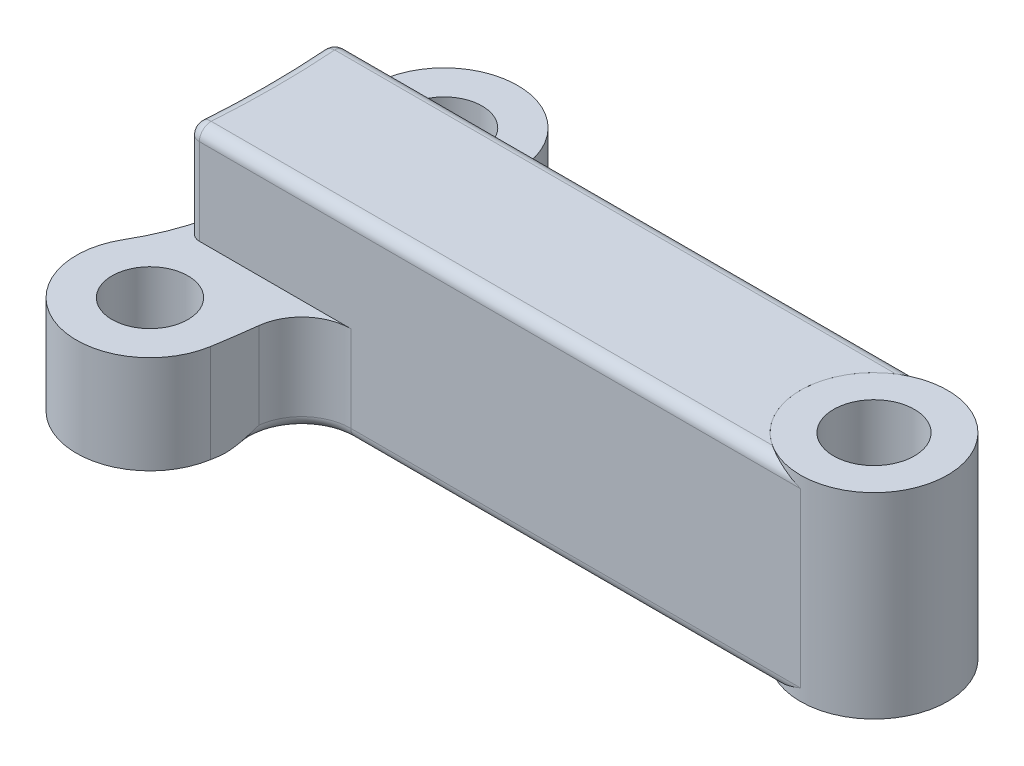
ISO-10303-21;
HEADER;
FILE_DESCRIPTION(('STEP AP214'),'2;1');
FILE_NAME('part.step','',(''),(''),'','','');
FILE_SCHEMA(('AUTOMOTIVE_DESIGN { 1 0 10303 214 1 1 1 1 }'));
ENDSEC;
DATA;
#1=APPLICATION_CONTEXT('core data for automotive mechanical design processes');
#2=APPLICATION_PROTOCOL_DEFINITION('international standard','automotive_design',2000,#1);
#3=PRODUCT_CONTEXT('',#1,'mechanical');
#4=PRODUCT('Part','Part','',(#3));
#5=PRODUCT_RELATED_PRODUCT_CATEGORY('part','',(#4));
#6=PRODUCT_DEFINITION_FORMATION('','',#4);
#7=PRODUCT_DEFINITION_CONTEXT('part definition',#1,'design');
#8=PRODUCT_DEFINITION('design','',#6,#7);
#9=PRODUCT_DEFINITION_SHAPE('','',#8);
#10=(LENGTH_UNIT() NAMED_UNIT(*) SI_UNIT(.MILLI.,.METRE.));
#11=(NAMED_UNIT(*) PLANE_ANGLE_UNIT() SI_UNIT($,.RADIAN.));
#12=(NAMED_UNIT(*) SI_UNIT($,.STERADIAN.) SOLID_ANGLE_UNIT());
#13=UNCERTAINTY_MEASURE_WITH_UNIT(LENGTH_MEASURE(1.E-05),#10,'distance_accuracy_value','');
#14=(GEOMETRIC_REPRESENTATION_CONTEXT(3) GLOBAL_UNCERTAINTY_ASSIGNED_CONTEXT((#13)) GLOBAL_UNIT_ASSIGNED_CONTEXT((#10,
#11,#12)) REPRESENTATION_CONTEXT('',''));
#15=CARTESIAN_POINT('',(0.,0.,0.));
#16=DIRECTION('',(0.,0.,1.));
#17=DIRECTION('',(1.,0.,0.));
#18=AXIS2_PLACEMENT_3D('',#15,#16,#17);
#19=CARTESIAN_POINT('',(5.027853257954,-0.00999999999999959,0.));
#20=DIRECTION('',(0.,1.,0.));
#21=DIRECTION('',(0.,0.,1.));
#22=AXIS2_PLACEMENT_3D('',#19,#20,#21);
#23=CYLINDRICAL_SURFACE('',#22,4.7625);
#24=CARTESIAN_POINT('',(5.027853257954,0.,0.));
#25=DIRECTION('',(0.,1.,0.));
#26=DIRECTION('',(0.,0.,1.));
#27=AXIS2_PLACEMENT_3D('',#24,#25,#26);
#28=CIRCLE('',#27,4.7625);
#29=CARTESIAN_POINT('',(5.027853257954,0.,4.7625));
#30=VERTEX_POINT('',#29);
#31=EDGE_CURVE('E56',#30,#30,#28,.T.);
#32=ORIENTED_EDGE('',*,*,#31,.T.);
#33=EDGE_LOOP('',(#32));
#34=FACE_BOUND('',#33,.T.);
#35=CARTESIAN_POINT('',(5.027853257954,12.7,0.));
#36=DIRECTION('',(0.,1.,0.));
#37=DIRECTION('',(0.,0.,1.));
#38=AXIS2_PLACEMENT_3D('',#35,#36,#37);
#39=CIRCLE('',#38,4.7625);
#40=CARTESIAN_POINT('',(5.027853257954,12.7,4.7625));
#41=VERTEX_POINT('',#40);
#42=EDGE_CURVE('E58',#41,#41,#39,.T.);
#43=ORIENTED_EDGE('',*,*,#42,.F.);
#44=EDGE_LOOP('',(#43));
#45=FACE_BOUND('',#44,.T.);
#46=ADVANCED_FACE('F45',(#34,#45),#23,.T.);
#47=CARTESIAN_POINT('',(5.027853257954,12.7,0.));
#48=DIRECTION('',(0.,-1.,0.));
#49=DIRECTION('',(0.,0.,-1.));
#50=AXIS2_PLACEMENT_3D('',#47,#48,#49);
#51=CYLINDRICAL_SURFACE('',#50,2.6162);
#52=CARTESIAN_POINT('',(5.027853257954,12.7,0.));
#53=DIRECTION('',(0.,1.,0.));
#54=DIRECTION('',(0.,0.,1.));
#55=AXIS2_PLACEMENT_3D('',#52,#53,#54);
#56=CIRCLE('',#55,2.6162);
#57=CARTESIAN_POINT('',(5.027853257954,12.7,2.6162));
#58=VERTEX_POINT('',#57);
#59=EDGE_CURVE('E49',#58,#58,#56,.T.);
#60=ORIENTED_EDGE('',*,*,#59,.T.);
#61=EDGE_LOOP('',(#60));
#62=FACE_BOUND('',#61,.T.);
#63=CARTESIAN_POINT('',(5.027853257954,0.,0.));
#64=DIRECTION('',(0.,1.,0.));
#65=DIRECTION('',(0.,0.,1.));
#66=AXIS2_PLACEMENT_3D('',#63,#64,#65);
#67=CIRCLE('',#66,2.6162);
#68=CARTESIAN_POINT('',(5.027853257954,0.,2.6162));
#69=VERTEX_POINT('',#68);
#70=EDGE_CURVE('E11',#69,#69,#67,.T.);
#71=ORIENTED_EDGE('',*,*,#70,.F.);
#72=EDGE_LOOP('',(#71));
#73=FACE_BOUND('',#72,.T.);
#74=ADVANCED_FACE('F71',(#62,#73),#51,.F.);
#75=CARTESIAN_POINT('',(5.027853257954,12.7,0.));
#76=DIRECTION('',(0.,1.,0.));
#77=DIRECTION('',(0.,0.,1.));
#78=AXIS2_PLACEMENT_3D('',#75,#76,#77);
#79=PLANE('',#78);
#80=ORIENTED_EDGE('',*,*,#59,.F.);
#81=EDGE_LOOP('',(#80));
#82=FACE_BOUND('',#81,.T.);
#83=ORIENTED_EDGE('',*,*,#42,.T.);
#84=EDGE_LOOP('',(#83));
#85=FACE_BOUND('',#84,.T.);
#86=ADVANCED_FACE('F67',(#82,#85),#79,.T.);
#87=CARTESIAN_POINT('',(5.027853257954,0.,0.));
#88=DIRECTION('',(0.,1.,0.));
#89=DIRECTION('',(0.,0.,1.));
#90=AXIS2_PLACEMENT_3D('',#87,#88,#89);
#91=PLANE('',#90);
#92=ORIENTED_EDGE('',*,*,#70,.T.);
#93=EDGE_LOOP('',(#92));
#94=FACE_BOUND('',#93,.T.);
#95=ORIENTED_EDGE('',*,*,#31,.F.);
#96=EDGE_LOOP('',(#95));
#97=FACE_BOUND('',#96,.T.);
#98=ADVANCED_FACE('F47',(#94,#97),#91,.F.);
#99=CLOSED_SHELL('',(#46,#74,#86,#98));
#100=MANIFOLD_SOLID_BREP('B2',#99);
#101=CARTESIAN_POINT('',(5.027853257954,-0.00999999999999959,0.));
#102=DIRECTION('',(0.,1.,0.));
#103=DIRECTION('',(0.,0.,1.));
#104=AXIS2_PLACEMENT_3D('',#101,#102,#103);
#105=CYLINDRICAL_SURFACE('',#104,4.7625);
#106=CARTESIAN_POINT('',(5.027853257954,0.,0.));
#107=DIRECTION('',(0.,1.,0.));
#108=DIRECTION('',(0.,0.,1.));
#109=AXIS2_PLACEMENT_3D('',#106,#107,#108);
#110=CIRCLE('',#109,4.7625);
#111=CARTESIAN_POINT('',(2.44378553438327,0.,-4.0005));
#112=VERTEX_POINT('',#111);
#113=CARTESIAN_POINT('',(2.44378553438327,0.,4.0005));
#114=VERTEX_POINT('',#113);
#115=EDGE_CURVE('E300',#112,#114,#110,.T.);
#116=ORIENTED_EDGE('',*,*,#115,.F.);
#117=CARTESIAN_POINT('',(2.44378553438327,0.,-4.0005));
#118=CARTESIAN_POINT('',(2.47813314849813,4.36418421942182E-06,-4.02268732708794));
#119=CARTESIAN_POINT('',(2.5127560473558,0.000968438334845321,-4.0444235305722));
#120=CARTESIAN_POINT('',(2.5824690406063,0.004618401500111,-4.08695083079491));
#121=CARTESIAN_POINT('',(2.617558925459,0.00730354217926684,-4.10774233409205));
#122=CARTESIAN_POINT('',(2.72327852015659,0.0176291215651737,-4.16856567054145));
#123=CARTESIAN_POINT('',(2.79452491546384,0.0275416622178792,-4.20715392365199));
#124=CARTESIAN_POINT('',(2.93775678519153,0.0521159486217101,-4.2801084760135));
#125=CARTESIAN_POINT('',(3.00973524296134,0.0667487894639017,-4.31449875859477));
#126=CARTESIAN_POINT('',(3.15462543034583,0.0998518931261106,-4.3793526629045));
#127=CARTESIAN_POINT('',(3.22753784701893,0.118325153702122,-4.4098131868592));
#128=CARTESIAN_POINT('',(3.41705593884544,0.170090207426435,-4.48355857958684));
#129=CARTESIAN_POINT('',(3.53418878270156,0.205715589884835,-4.52387700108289));
#130=CARTESIAN_POINT('',(3.76954514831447,0.282365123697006,-4.59490975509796));
#131=CARTESIAN_POINT('',(3.88776904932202,0.323391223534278,-4.62562060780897));
#132=CARTESIAN_POINT('',(4.24396957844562,0.452068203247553,-4.70383818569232));
#133=CARTESIAN_POINT('',(4.48321037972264,0.545237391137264,-4.73732879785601));
#134=CARTESIAN_POINT('',(4.82000784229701,0.678881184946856,-4.75896482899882));
#135=CARTESIAN_POINT('',(4.91751882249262,0.717867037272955,-4.762220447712));
#136=CARTESIAN_POINT('',(5.01930990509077,0.758582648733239,-4.76249424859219));
#137=CARTESIAN_POINT('',(5.02358157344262,0.760291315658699,-4.76249999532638));
#138=CARTESIAN_POINT('',(5.027853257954,0.762000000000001,-4.7625));
#139=B_SPLINE_CURVE_WITH_KNOTS('',3,(#117,#118,#119,#120,#121,#122,#123,#124,#125,#126,#127,
#128,#129,#130,#131,#132,#133,#134,#135,#136,#137,#138),.UNSPECIFIED.,.F.,.F.,(4,2,2,2,2,2,2,2,
2,2,4),(0.,0.122635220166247,0.245217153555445,0.489788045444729,0.73288885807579,
0.976180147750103,1.36226841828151,1.74849636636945,2.52182618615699,2.83692234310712,
2.85072452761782),.UNSPECIFIED.);
#140=CARTESIAN_POINT('',(5.027853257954,0.762000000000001,-4.7625));
#141=VERTEX_POINT('',#140);
#142=EDGE_CURVE('E407',#112,#141,#139,.T.);
#143=ORIENTED_EDGE('',*,*,#142,.T.);
#144=DIRECTION('',(0.,-1.,0.));
#145=VECTOR('',#144,1.);
#146=CARTESIAN_POINT('',(5.027853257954,12.7,-4.7625));
#147=LINE('',#146,#145);
#148=CARTESIAN_POINT('',(5.027853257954,11.938,-4.7625));
#149=VERTEX_POINT('',#148);
#150=EDGE_CURVE('E290',#149,#141,#147,.T.);
#151=ORIENTED_EDGE('',*,*,#150,.F.);
#152=CARTESIAN_POINT('',(2.44378553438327,12.7,-4.0005));
#153=CARTESIAN_POINT('',(2.47813314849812,12.6999956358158,-4.02268732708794));
#154=CARTESIAN_POINT('',(2.51275604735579,12.6990315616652,-4.04442353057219));
#155=CARTESIAN_POINT('',(2.58246904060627,12.6953815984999,-4.08695083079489));
#156=CARTESIAN_POINT('',(2.61755892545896,12.6926964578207,-4.10774233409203));
#157=CARTESIAN_POINT('',(2.72327852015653,12.6823708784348,-4.16856567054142));
#158=CARTESIAN_POINT('',(2.79452491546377,12.6724583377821,-4.20715392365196));
#159=CARTESIAN_POINT('',(2.93775678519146,12.6478840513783,-4.28010847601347));
#160=CARTESIAN_POINT('',(3.00973524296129,12.6332512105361,-4.31449875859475));
#161=CARTESIAN_POINT('',(3.15462543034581,12.6001481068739,-4.37935266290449));
#162=CARTESIAN_POINT('',(3.22753784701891,12.5816748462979,-4.4098131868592));
#163=CARTESIAN_POINT('',(3.41705593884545,12.5299097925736,-4.48355857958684));
#164=CARTESIAN_POINT('',(3.53418878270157,12.4942844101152,-4.5238770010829));
#165=CARTESIAN_POINT('',(3.76954514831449,12.417634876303,-4.59490975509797));
#166=CARTESIAN_POINT('',(3.88776904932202,12.3766087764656,-4.62562060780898));
#167=CARTESIAN_POINT('',(4.2439695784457,12.2479317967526,-4.70383818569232));
#168=CARTESIAN_POINT('',(4.48321037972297,12.1547626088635,-4.737328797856));
#169=CARTESIAN_POINT('',(4.82000784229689,12.0211188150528,-4.75896482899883));
#170=CARTESIAN_POINT('',(4.91751882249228,11.9821329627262,-4.76222044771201));
#171=CARTESIAN_POINT('',(5.01930990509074,11.9414173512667,-4.76249424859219));
#172=CARTESIAN_POINT('',(5.0235815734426,11.9397086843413,-4.76249999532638));
#173=CARTESIAN_POINT('',(5.027853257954,11.938,-4.7625));
#174=B_SPLINE_CURVE_WITH_KNOTS('',3,(#152,#153,#154,#155,#156,#157,#158,#159,#160,#161,#162,
#163,#164,#165,#166,#167,#168,#169,#170,#171,#172,#173),.UNSPECIFIED.,.F.,.F.,(4,2,2,2,2,2,2,2,
2,2,4),(0.,0.122635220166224,0.245217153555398,0.489788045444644,0.732888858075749,
0.976180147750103,1.36226841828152,1.74849636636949,2.521826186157,2.83692234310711,
2.85072452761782),.UNSPECIFIED.);
#175=CARTESIAN_POINT('',(2.44378553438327,12.7,-4.0005));
#176=VERTEX_POINT('',#175);
#177=EDGE_CURVE('E408',#149,#176,#174,.F.);
#178=ORIENTED_EDGE('',*,*,#177,.T.);
#179=CARTESIAN_POINT('',(5.027853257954,12.7,0.));
#180=DIRECTION('',(0.,1.,0.));
#181=DIRECTION('',(0.,0.,1.));
#182=AXIS2_PLACEMENT_3D('',#179,#180,#181);
#183=CIRCLE('',#182,4.7625);
#184=CARTESIAN_POINT('',(2.44378553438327,12.7,4.0005));
#185=VERTEX_POINT('',#184);
#186=EDGE_CURVE('E295',#176,#185,#183,.T.);
#187=ORIENTED_EDGE('',*,*,#186,.T.);
#188=CARTESIAN_POINT('',(2.44378553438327,12.7,4.0005));
#189=CARTESIAN_POINT('',(2.47813314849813,12.6999956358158,4.02268732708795));
#190=CARTESIAN_POINT('',(2.5127560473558,12.6990315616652,4.0444235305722));
#191=CARTESIAN_POINT('',(2.58246904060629,12.6953815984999,4.08695083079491));
#192=CARTESIAN_POINT('',(2.61755892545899,12.6926964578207,4.10774233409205));
#193=CARTESIAN_POINT('',(2.72327852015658,12.6823708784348,4.16856567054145));
#194=CARTESIAN_POINT('',(2.79452491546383,12.6724583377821,4.20715392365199));
#195=CARTESIAN_POINT('',(2.93775678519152,12.6478840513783,4.28010847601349));
#196=CARTESIAN_POINT('',(3.00973524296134,12.6332512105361,4.31449875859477));
#197=CARTESIAN_POINT('',(3.15462543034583,12.6001481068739,4.3793526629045));
#198=CARTESIAN_POINT('',(3.22753784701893,12.5816748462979,4.4098131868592));
#199=CARTESIAN_POINT('',(3.41705593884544,12.5299097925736,4.48355857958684));
#200=CARTESIAN_POINT('',(3.53418878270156,12.4942844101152,4.52387700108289));
#201=CARTESIAN_POINT('',(3.76954514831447,12.417634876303,4.59490975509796));
#202=CARTESIAN_POINT('',(3.88776904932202,12.3766087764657,4.62562060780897));
#203=CARTESIAN_POINT('',(4.24396957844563,12.2479317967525,4.70383818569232));
#204=CARTESIAN_POINT('',(4.48321037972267,12.1547626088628,4.73732879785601));
#205=CARTESIAN_POINT('',(4.820007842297,12.0211188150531,4.75896482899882));
#206=CARTESIAN_POINT('',(4.9175188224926,11.982132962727,4.762220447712));
#207=CARTESIAN_POINT('',(5.01930990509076,11.9414173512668,4.76249424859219));
#208=CARTESIAN_POINT('',(5.02358157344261,11.9397086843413,4.76249999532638));
#209=CARTESIAN_POINT('',(5.027853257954,11.938,4.7625));
#210=B_SPLINE_CURVE_WITH_KNOTS('',3,(#188,#189,#190,#191,#192,#193,#194,#195,#196,#197,#198,
#199,#200,#201,#202,#203,#204,#205,#206,#207,#208,#209),.UNSPECIFIED.,.F.,.F.,(4,2,2,2,2,2,2,2,
2,2,4),(0.,0.122635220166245,0.245217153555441,0.489788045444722,0.732888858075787,
0.976180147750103,1.36226841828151,1.74849636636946,2.52182618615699,2.83692234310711,
2.85072452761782),.UNSPECIFIED.);
#211=CARTESIAN_POINT('',(5.027853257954,11.938,4.7625));
#212=VERTEX_POINT('',#211);
#213=EDGE_CURVE('E385',#185,#212,#210,.T.);
#214=ORIENTED_EDGE('',*,*,#213,.T.);
#215=DIRECTION('',(0.,-1.,0.));
#216=VECTOR('',#215,1.);
#217=CARTESIAN_POINT('',(5.027853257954,12.7,4.7625));
#218=LINE('',#217,#216);
#219=CARTESIAN_POINT('',(5.027853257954,0.762000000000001,4.7625));
#220=VERTEX_POINT('',#219);
#221=EDGE_CURVE('E291',#212,#220,#218,.T.);
#222=ORIENTED_EDGE('',*,*,#221,.T.);
#223=CARTESIAN_POINT('',(2.44378553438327,0.,4.0005));
#224=CARTESIAN_POINT('',(2.47813314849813,4.36418421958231E-06,4.02268732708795));
#225=CARTESIAN_POINT('',(2.5127560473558,0.000968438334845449,4.0444235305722));
#226=CARTESIAN_POINT('',(2.5824690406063,0.00461840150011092,4.08695083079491));
#227=CARTESIAN_POINT('',(2.61755892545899,0.00730354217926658,4.10774233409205));
#228=CARTESIAN_POINT('',(2.72327852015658,0.0176291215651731,4.16856567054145));
#229=CARTESIAN_POINT('',(2.79452491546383,0.0275416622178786,4.20715392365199));
#230=CARTESIAN_POINT('',(2.93775678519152,0.0521159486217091,4.28010847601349));
#231=CARTESIAN_POINT('',(3.00973524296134,0.0667487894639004,4.31449875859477));
#232=CARTESIAN_POINT('',(3.15462543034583,0.0998518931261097,4.3793526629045));
#233=CARTESIAN_POINT('',(3.22753784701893,0.118325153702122,4.4098131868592));
#234=CARTESIAN_POINT('',(3.41705593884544,0.170090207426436,4.48355857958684));
#235=CARTESIAN_POINT('',(3.53418878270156,0.205715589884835,4.52387700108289));
#236=CARTESIAN_POINT('',(3.76954514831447,0.282365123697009,4.59490975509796));
#237=CARTESIAN_POINT('',(3.88776904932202,0.323391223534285,4.62562060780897));
#238=CARTESIAN_POINT('',(4.24396957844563,0.452068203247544,4.70383818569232));
#239=CARTESIAN_POINT('',(4.48321037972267,0.545237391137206,4.73732879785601));
#240=CARTESIAN_POINT('',(4.82000784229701,0.678881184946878,4.75896482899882));
#241=CARTESIAN_POINT('',(4.9175188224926,0.717867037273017,4.762220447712));
#242=CARTESIAN_POINT('',(5.01930990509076,0.758582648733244,4.76249424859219));
#243=CARTESIAN_POINT('',(5.02358157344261,0.760291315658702,4.76249999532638));
#244=CARTESIAN_POINT('',(5.027853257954,0.762000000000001,4.7625));
#245=B_SPLINE_CURVE_WITH_KNOTS('',3,(#223,#224,#225,#226,#227,#228,#229,#230,#231,#232,#233,
#234,#235,#236,#237,#238,#239,#240,#241,#242,#243,#244),.UNSPECIFIED.,.F.,.F.,(4,2,2,2,2,2,2,2,
2,2,4),(0.,0.122635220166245,0.245217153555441,0.489788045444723,0.732888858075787,
0.976180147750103,1.36226841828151,1.74849636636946,2.521826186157,2.83692234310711,
2.85072452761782),.UNSPECIFIED.);
#246=EDGE_CURVE('E402',#220,#114,#245,.F.);
#247=ORIENTED_EDGE('',*,*,#246,.T.);
#248=EDGE_LOOP('',(#116,#143,#151,#178,#187,#214,#222,#247));
#249=FACE_BOUND('',#248,.T.);
#250=ADVANCED_FACE('F113',(#249),#105,.F.);
#251=CARTESIAN_POINT('',(-34.7236357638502,12.7,-4.76249999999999));
#252=DIRECTION('',(0.,0.,1.));
#253=DIRECTION('',(1.,0.,0.));
#254=AXIS2_PLACEMENT_3D('',#251,#252,#253);
#255=PLANE('',#254);
#256=ORIENTED_EDGE('',*,*,#150,.T.);
#257=DIRECTION('',(-1.,0.,0.));
#258=VECTOR('',#257,1.);
#259=CARTESIAN_POINT('',(-34.7236357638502,0.762000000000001,-4.76249999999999));
#260=LINE('',#259,#258);
#261=CARTESIAN_POINT('',(-24.0975029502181,0.762000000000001,-4.76249999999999));
#262=VERTEX_POINT('',#261);
#263=EDGE_CURVE('E336',#141,#262,#260,.T.);
#264=ORIENTED_EDGE('',*,*,#263,.T.);
#265=DIRECTION('',(0.,1.,0.));
#266=VECTOR('',#265,1.);
#267=CARTESIAN_POINT('',(-24.0975029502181,6.35,-4.76249999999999));
#268=LINE('',#267,#266);
#269=CARTESIAN_POINT('',(-24.0975029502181,6.35,-4.76249999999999));
#270=VERTEX_POINT('',#269);
#271=EDGE_CURVE('E306',#262,#270,#268,.T.);
#272=ORIENTED_EDGE('',*,*,#271,.T.);
#273=DIRECTION('',(1.,0.,0.));
#274=VECTOR('',#273,1.);
#275=CARTESIAN_POINT('',(-34.7236357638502,6.35,-4.76249999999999));
#276=LINE('',#275,#274);
#277=CARTESIAN_POINT('',(-33.8996514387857,6.35,-4.76249999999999));
#278=VERTEX_POINT('',#277);
#279=EDGE_CURVE('E288',#278,#270,#276,.T.);
#280=ORIENTED_EDGE('',*,*,#279,.F.);
#281=DIRECTION('',(0.,-1.,0.));
#282=VECTOR('',#281,1.);
#283=CARTESIAN_POINT('',(-33.8996514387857,12.7,-4.76249999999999));
#284=LINE('',#283,#282);
#285=CARTESIAN_POINT('',(-33.8996514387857,11.938,-4.76249999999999));
#286=VERTEX_POINT('',#285);
#287=EDGE_CURVE('E334',#278,#286,#284,.F.);
#288=ORIENTED_EDGE('',*,*,#287,.T.);
#289=DIRECTION('',(-1.,0.,0.));
#290=VECTOR('',#289,1.);
#291=CARTESIAN_POINT('',(5.027853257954,11.938,-4.7625));
#292=LINE('',#291,#290);
#293=EDGE_CURVE('E332',#286,#149,#292,.F.);
#294=ORIENTED_EDGE('',*,*,#293,.T.);
#295=EDGE_LOOP('',(#256,#264,#272,#280,#288,#294));
#296=FACE_BOUND('',#295,.T.);
#297=ADVANCED_FACE('F421',(#296),#255,.F.);
#298=CARTESIAN_POINT('',(-90.298346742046,12.7,1.97098871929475E-13));
#299=DIRECTION('',(0.,-1.,0.));
#300=DIRECTION('',(0.,0.,-1.));
#301=AXIS2_PLACEMENT_3D('',#298,#299,#300);
#302=CYLINDRICAL_SURFACE('',#301,55.7784);
#303=CARTESIAN_POINT('',(-90.298346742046,11.938,1.97098871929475E-13));
#304=DIRECTION('',(0.,1.,0.));
#305=DIRECTION('',(0.,0.,1.));
#306=AXIS2_PLACEMENT_3D('',#303,#304,#305);
#307=CIRCLE('',#306,55.7784);
#308=CARTESIAN_POINT('',(-34.6597416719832,11.938,3.94658490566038));
#309=VERTEX_POINT('',#308);
#310=CARTESIAN_POINT('',(-34.6597416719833,11.938,-3.94658490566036));
#311=VERTEX_POINT('',#310);
#312=EDGE_CURVE('E328',#309,#311,#307,.T.);
#313=ORIENTED_EDGE('',*,*,#312,.T.);
#314=DIRECTION('',(0.,-1.,0.));
#315=VECTOR('',#314,1.);
#316=CARTESIAN_POINT('',(-34.6597416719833,12.7,-3.94658490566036));
#317=LINE('',#316,#315);
#318=CARTESIAN_POINT('',(-34.6597416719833,6.35,-3.94658490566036));
#319=VERTEX_POINT('',#318);
#320=EDGE_CURVE('E330',#311,#319,#317,.T.);
#321=ORIENTED_EDGE('',*,*,#320,.T.);
#322=CARTESIAN_POINT('',(-90.298346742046,6.35,1.97098871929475E-13));
#323=DIRECTION('',(0.,-1.,0.));
#324=DIRECTION('',(0.,0.,-1.));
#325=AXIS2_PLACEMENT_3D('',#322,#323,#324);
#326=CIRCLE('',#325,55.7784);
#327=CARTESIAN_POINT('',(-34.519946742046,6.35,0.));
#328=VERTEX_POINT('',#327);
#329=EDGE_CURVE('E282',#328,#319,#326,.F.);
#330=ORIENTED_EDGE('',*,*,#329,.F.);
#331=CARTESIAN_POINT('',(-34.6597416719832,6.35,3.94658490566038));
#332=VERTEX_POINT('',#331);
#333=EDGE_CURVE('E258',#332,#328,#326,.F.);
#334=ORIENTED_EDGE('',*,*,#333,.F.);
#335=DIRECTION('',(0.,-1.,0.));
#336=VECTOR('',#335,1.);
#337=CARTESIAN_POINT('',(-34.6597416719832,12.7,3.94658490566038));
#338=LINE('',#337,#336);
#339=EDGE_CURVE('E326',#332,#309,#338,.F.);
#340=ORIENTED_EDGE('',*,*,#339,.T.);
#341=EDGE_LOOP('',(#313,#321,#330,#334,#340));
#342=FACE_BOUND('',#341,.T.);
#343=ADVANCED_FACE('F551',(#342),#302,.F.);
#344=CARTESIAN_POINT('',(-34.7236357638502,12.7,4.7625));
#345=DIRECTION('',(0.,0.,-1.));
#346=DIRECTION('',(-1.,0.,0.));
#347=AXIS2_PLACEMENT_3D('',#344,#345,#346);
#348=PLANE('',#347);
#349=DIRECTION('',(0.,1.,0.));
#350=VECTOR('',#349,1.);
#351=CARTESIAN_POINT('',(-24.0975029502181,0.,4.7625));
#352=LINE('',#351,#350);
#353=CARTESIAN_POINT('',(-24.0975029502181,6.35,4.7625));
#354=VERTEX_POINT('',#353);
#355=CARTESIAN_POINT('',(-24.0975029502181,0.762000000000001,4.7625));
#356=VERTEX_POINT('',#355);
#357=EDGE_CURVE('E311',#354,#356,#352,.F.);
#358=ORIENTED_EDGE('',*,*,#357,.T.);
#359=DIRECTION('',(1.,0.,0.));
#360=VECTOR('',#359,1.);
#361=CARTESIAN_POINT('',(-34.7236357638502,0.762000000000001,4.7625));
#362=LINE('',#361,#360);
#363=EDGE_CURVE('E343',#356,#220,#362,.T.);
#364=ORIENTED_EDGE('',*,*,#363,.T.);
#365=ORIENTED_EDGE('',*,*,#221,.F.);
#366=DIRECTION('',(1.,0.,0.));
#367=VECTOR('',#366,1.);
#368=CARTESIAN_POINT('',(-34.7236357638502,11.938,4.7625));
#369=LINE('',#368,#367);
#370=CARTESIAN_POINT('',(-33.8996514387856,11.938,4.7625));
#371=VERTEX_POINT('',#370);
#372=EDGE_CURVE('E339',#212,#371,#369,.F.);
#373=ORIENTED_EDGE('',*,*,#372,.T.);
#374=DIRECTION('',(0.,-1.,0.));
#375=VECTOR('',#374,1.);
#376=CARTESIAN_POINT('',(-33.8996514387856,12.7,4.7625));
#377=LINE('',#376,#375);
#378=CARTESIAN_POINT('',(-33.8996514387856,6.35,4.7625));
#379=VERTEX_POINT('',#378);
#380=EDGE_CURVE('E341',#371,#379,#377,.T.);
#381=ORIENTED_EDGE('',*,*,#380,.T.);
#382=DIRECTION('',(-1.,0.,0.));
#383=VECTOR('',#382,1.);
#384=CARTESIAN_POINT('',(-34.7236357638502,6.35,4.7625));
#385=LINE('',#384,#383);
#386=EDGE_CURVE('E298',#354,#379,#385,.T.);
#387=ORIENTED_EDGE('',*,*,#386,.F.);
#388=EDGE_LOOP('',(#358,#364,#365,#373,#381,#387));
#389=FACE_BOUND('',#388,.T.);
#390=ADVANCED_FACE('F539',(#389),#348,.F.);
#391=CARTESIAN_POINT('',(5.027853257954,12.7,0.));
#392=DIRECTION('',(0.,1.,0.));
#393=DIRECTION('',(0.,0.,1.));
#394=AXIS2_PLACEMENT_3D('',#391,#392,#393);
#395=PLANE('',#394);
#396=ORIENTED_EDGE('',*,*,#186,.F.);
#397=DIRECTION('',(-1.,0.,0.));
#398=VECTOR('',#397,1.);
#399=CARTESIAN_POINT('',(-34.7236357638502,12.7,-4.00049999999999));
#400=LINE('',#399,#398);
#401=CARTESIAN_POINT('',(-33.8996514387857,12.7,-4.00049999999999));
#402=VERTEX_POINT('',#401);
#403=EDGE_CURVE('E324',#176,#402,#400,.T.);
#404=ORIENTED_EDGE('',*,*,#403,.T.);
#405=CARTESIAN_POINT('',(-90.298346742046,12.7,1.97098871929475E-13));
#406=DIRECTION('',(0.,1.,0.));
#407=DIRECTION('',(0.,0.,1.));
#408=AXIS2_PLACEMENT_3D('',#405,#406,#407);
#409=CIRCLE('',#408,56.5404);
#410=CARTESIAN_POINT('',(-33.8996514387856,12.7,4.0005));
#411=VERTEX_POINT('',#410);
#412=EDGE_CURVE('E321',#402,#411,#409,.F.);
#413=ORIENTED_EDGE('',*,*,#412,.T.);
#414=DIRECTION('',(1.,0.,0.));
#415=VECTOR('',#414,1.);
#416=CARTESIAN_POINT('',(5.027853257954,12.7,4.0005));
#417=LINE('',#416,#415);
#418=EDGE_CURVE('E319',#411,#185,#417,.T.);
#419=ORIENTED_EDGE('',*,*,#418,.T.);
#420=EDGE_LOOP('',(#396,#404,#413,#419));
#421=FACE_BOUND('',#420,.T.);
#422=ADVANCED_FACE('F589',(#421),#395,.T.);
#423=CARTESIAN_POINT('',(5.027853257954,0.,0.));
#424=DIRECTION('',(0.,1.,0.));
#425=DIRECTION('',(0.,0.,1.));
#426=AXIS2_PLACEMENT_3D('',#423,#424,#425);
#427=PLANE('',#426);
#428=CARTESIAN_POINT('',(-32.3382891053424,0.,9.525));
#429=DIRECTION('',(0.,1.,0.));
#430=DIRECTION('',(0.,0.,1.));
#431=AXIS2_PLACEMENT_3D('',#428,#429,#430);
#432=CIRCLE('',#431,2.45745);
#433=CARTESIAN_POINT('',(-32.3382891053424,0.,11.98245));
#434=VERTEX_POINT('',#433);
#435=EDGE_CURVE('E561',#434,#434,#432,.T.);
#436=ORIENTED_EDGE('',*,*,#435,.T.);
#437=EDGE_LOOP('',(#436));
#438=FACE_BOUND('',#437,.T.);
#439=CARTESIAN_POINT('',(-32.3382891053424,0.,-9.525));
#440=DIRECTION('',(0.,1.,0.));
#441=DIRECTION('',(0.,0.,1.));
#442=AXIS2_PLACEMENT_3D('',#439,#440,#441);
#443=CIRCLE('',#442,2.45745);
#444=CARTESIAN_POINT('',(-32.3382891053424,0.,-7.06755));
#445=VERTEX_POINT('',#444);
#446=EDGE_CURVE('E553',#445,#445,#443,.T.);
#447=ORIENTED_EDGE('',*,*,#446,.T.);
#448=EDGE_LOOP('',(#447));
#449=FACE_BOUND('',#448,.T.);
#450=CARTESIAN_POINT('',(-90.298346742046,0.,1.97098871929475E-13));
#451=DIRECTION('',(0.,1.,0.));
#452=DIRECTION('',(0.,0.,1.));
#453=AXIS2_PLACEMENT_3D('',#450,#451,#452);
#454=CIRCLE('',#453,63.5);
#455=CARTESIAN_POINT('',(-27.5606895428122,0.,-9.81001371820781));
#456=VERTEX_POINT('',#455);
#457=CARTESIAN_POINT('',(-27.6388249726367,0.,-10.2972972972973));
#458=VERTEX_POINT('',#457);
#459=EDGE_CURVE('E505',#456,#458,#454,.T.);
#460=ORIENTED_EDGE('',*,*,#459,.F.);
#461=CARTESIAN_POINT('',(-24.0975029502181,0.,-7.93749999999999));
#462=DIRECTION('',(0.,1.,0.));
#463=DIRECTION('',(0.,0.,1.));
#464=AXIS2_PLACEMENT_3D('',#461,#462,#463);
#465=CIRCLE('',#464,3.937);
#466=CARTESIAN_POINT('',(-24.0975029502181,0.,-4.00049999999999));
#467=VERTEX_POINT('',#466);
#468=EDGE_CURVE('E353',#456,#467,#465,.T.);
#469=ORIENTED_EDGE('',*,*,#468,.T.);
#470=DIRECTION('',(-1.,0.,0.));
#471=VECTOR('',#470,1.);
#472=CARTESIAN_POINT('',(5.027853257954,0.,-4.0005));
#473=LINE('',#472,#471);
#474=EDGE_CURVE('E350',#467,#112,#473,.F.);
#475=ORIENTED_EDGE('',*,*,#474,.T.);
#476=ORIENTED_EDGE('',*,*,#115,.T.);
#477=DIRECTION('',(1.,0.,0.));
#478=VECTOR('',#477,1.);
#479=CARTESIAN_POINT('',(5.027853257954,0.,4.0005));
#480=LINE('',#479,#478);
#481=CARTESIAN_POINT('',(-24.0975029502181,0.,4.0005));
#482=VERTEX_POINT('',#481);
#483=EDGE_CURVE('E345',#114,#482,#480,.F.);
#484=ORIENTED_EDGE('',*,*,#483,.T.);
#485=CARTESIAN_POINT('',(-24.0975029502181,0.,7.9375));
#486=DIRECTION('',(0.,1.,0.));
#487=DIRECTION('',(0.,0.,1.));
#488=AXIS2_PLACEMENT_3D('',#485,#486,#487);
#489=CIRCLE('',#488,3.937);
#490=CARTESIAN_POINT('',(-27.5606895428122,0.,9.81001371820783));
#491=VERTEX_POINT('',#490);
#492=EDGE_CURVE('E347',#482,#491,#489,.T.);
#493=ORIENTED_EDGE('',*,*,#492,.T.);
#494=CARTESIAN_POINT('',(-27.6388249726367,0.,10.2972972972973));
#495=VERTEX_POINT('',#494);
#496=EDGE_CURVE('E509',#495,#491,#454,.T.);
#497=ORIENTED_EDGE('',*,*,#496,.F.);
#498=CARTESIAN_POINT('',(-32.3382891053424,0.,9.52500000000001));
#499=DIRECTION('',(0.,1.,0.));
#500=DIRECTION('',(0.,0.,-1.));
#501=AXIS2_PLACEMENT_3D('',#498,#499,#500);
#502=CIRCLE('',#501,4.7625);
#503=CARTESIAN_POINT('',(-36.4493261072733,0.,7.12067451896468));
#504=VERTEX_POINT('',#503);
#505=EDGE_CURVE('E510',#504,#495,#502,.T.);
#506=ORIENTED_EDGE('',*,*,#505,.F.);
#507=CARTESIAN_POINT('',(-48.6246146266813,0.,0.));
#508=DIRECTION('',(0.,-1.,0.));
#509=DIRECTION('',(0.,0.,-1.));
#510=AXIS2_PLACEMENT_3D('',#507,#508,#509);
#511=CIRCLE('',#510,14.1046678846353);
#512=CARTESIAN_POINT('',(-36.4493261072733,0.,-7.12067451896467));
#513=VERTEX_POINT('',#512);
#514=EDGE_CURVE('E279',#513,#504,#511,.T.);
#515=ORIENTED_EDGE('',*,*,#514,.F.);
#516=CARTESIAN_POINT('',(-32.3382891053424,0.,-9.525));
#517=DIRECTION('',(0.,1.,0.));
#518=DIRECTION('',(0.,0.,1.));
#519=AXIS2_PLACEMENT_3D('',#516,#517,#518);
#520=CIRCLE('',#519,4.7625);
#521=EDGE_CURVE('E265',#458,#513,#520,.T.);
#522=ORIENTED_EDGE('',*,*,#521,.F.);
#523=EDGE_LOOP('',(#460,#469,#475,#476,#484,#493,#497,#506,#515,#522));
#524=FACE_BOUND('',#523,.T.);
#525=ADVANCED_FACE('F503',(#438,#449,#524),#427,.F.);
#526=CARTESIAN_POINT('',(-48.6246146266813,6.35,0.));
#527=DIRECTION('',(0.,-1.,0.));
#528=DIRECTION('',(0.,0.,-1.));
#529=AXIS2_PLACEMENT_3D('',#526,#527,#528);
#530=CYLINDRICAL_SURFACE('',#529,14.1046678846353);
#531=CARTESIAN_POINT('',(-48.6246146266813,6.35,0.));
#532=DIRECTION('',(0.,-1.,0.));
#533=DIRECTION('',(0.,0.,-1.));
#534=AXIS2_PLACEMENT_3D('',#531,#532,#533);
#535=CIRCLE('',#534,14.1046678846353);
#536=CARTESIAN_POINT('',(-36.4493261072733,6.35,7.12067451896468));
#537=VERTEX_POINT('',#536);
#538=EDGE_CURVE('E250',#328,#537,#535,.T.);
#539=ORIENTED_EDGE('',*,*,#538,.F.);
#540=CARTESIAN_POINT('',(-36.4493261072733,6.35,-7.12067451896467));
#541=VERTEX_POINT('',#540);
#542=EDGE_CURVE('E264',#541,#328,#535,.T.);
#543=ORIENTED_EDGE('',*,*,#542,.F.);
#544=DIRECTION('',(0.,-1.,0.));
#545=VECTOR('',#544,1.);
#546=CARTESIAN_POINT('',(-36.4493261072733,6.35,-7.12067451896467));
#547=LINE('',#546,#545);
#548=EDGE_CURVE('E516',#541,#513,#547,.T.);
#549=ORIENTED_EDGE('',*,*,#548,.T.);
#550=ORIENTED_EDGE('',*,*,#514,.T.);
#551=DIRECTION('',(0.,-1.,0.));
#552=VECTOR('',#551,1.);
#553=CARTESIAN_POINT('',(-36.4493261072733,6.35,7.12067451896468));
#554=LINE('',#553,#552);
#555=EDGE_CURVE('E270',#537,#504,#554,.T.);
#556=ORIENTED_EDGE('',*,*,#555,.F.);
#557=EDGE_LOOP('',(#539,#543,#549,#550,#556));
#558=FACE_BOUND('',#557,.T.);
#559=ADVANCED_FACE('F277',(#558),#530,.F.);
#560=CARTESIAN_POINT('',(-90.298346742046,6.35,1.97098871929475E-13));
#561=DIRECTION('',(0.,-1.,0.));
#562=DIRECTION('',(0.,0.,-1.));
#563=AXIS2_PLACEMENT_3D('',#560,#561,#562);
#564=CYLINDRICAL_SURFACE('',#563,63.5);
#565=DIRECTION('',(0.,-1.,0.));
#566=VECTOR('',#565,1.);
#567=CARTESIAN_POINT('',(-27.2499240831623,6.35,-7.55952380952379));
#568=LINE('',#567,#566);
#569=CARTESIAN_POINT('',(-27.2499240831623,6.35,-7.55952380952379));
#570=VERTEX_POINT('',#569);
#571=CARTESIAN_POINT('',(-27.2499240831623,0.762,-7.55952380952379));
#572=VERTEX_POINT('',#571);
#573=EDGE_CURVE('E294',#570,#572,#568,.T.);
#574=ORIENTED_EDGE('',*,*,#573,.T.);
#575=CARTESIAN_POINT('',(-27.5606895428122,0.,-9.81001371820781));
#576=CARTESIAN_POINT('',(-27.5545286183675,3.53396928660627E-06,-9.7706135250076));
#577=CARTESIAN_POINT('',(-27.5484074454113,0.00114840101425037,-9.73122321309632));
#578=CARTESIAN_POINT('',(-27.5362596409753,0.00551059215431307,-9.65256458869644));
#579=CARTESIAN_POINT('',(-27.5302329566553,0.00872671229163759,-9.61329621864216));
#580=CARTESIAN_POINT('',(-27.5123439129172,0.0211432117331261,-9.49600384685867));
#581=CARTESIAN_POINT('',(-27.5006338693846,0.0331144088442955,-9.41824504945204));
#582=CARTESIAN_POINT('',(-27.4778235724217,0.0628642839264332,-9.26486963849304));
#583=CARTESIAN_POINT('',(-27.4667173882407,0.0805657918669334,-9.18923832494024));
#584=CARTESIAN_POINT('',(-27.4449470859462,0.120730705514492,-9.03913194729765));
#585=CARTESIAN_POINT('',(-27.4342833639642,0.143198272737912,-8.96465795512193));
#586=CARTESIAN_POINT('',(-27.4076923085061,0.20524691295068,-8.77661075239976));
#587=CARTESIAN_POINT('',(-27.3920677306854,0.247476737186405,-8.66387578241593));
#588=CARTESIAN_POINT('',(-27.3617577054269,0.33820526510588,-8.44087681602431));
#589=CARTESIAN_POINT('',(-27.3470723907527,0.386704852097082,-8.33061317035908));
#590=CARTESIAN_POINT('',(-27.304107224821,0.53850984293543,-8.00156757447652));
#591=CARTESIAN_POINT('',(-27.2770451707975,0.647781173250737,-7.78543317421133));
#592=CARTESIAN_POINT('',(-27.2507044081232,0.758710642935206,-7.56602976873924));
#593=CARTESIAN_POINT('',(-27.2503141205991,0.760355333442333,-7.56277679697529));
#594=CARTESIAN_POINT('',(-27.2499240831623,0.762,-7.55952380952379));
#595=B_SPLINE_CURVE_WITH_KNOTS('',3,(#575,#576,#577,#578,#579,#580,#581,#582,#583,#584,#585,
#586,#587,#588,#589,#590,#591,#592,#593,#594),.UNSPECIFIED.,.F.,.F.,(4,2,2,2,2,2,2,2,2,4),(0.,
0.119595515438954,0.239121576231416,0.477425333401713,0.712644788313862,0.948070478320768,
1.31195226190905,1.6758853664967,2.40666009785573,2.41765793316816),.UNSPECIFIED.);
#596=EDGE_CURVE('E380',#572,#456,#595,.F.);
#597=ORIENTED_EDGE('',*,*,#596,.T.);
#598=ORIENTED_EDGE('',*,*,#459,.T.);
#599=DIRECTION('',(0.,-1.,0.));
#600=VECTOR('',#599,1.);
#601=CARTESIAN_POINT('',(-27.6388249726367,6.35,-10.2972972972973));
#602=LINE('',#601,#600);
#603=CARTESIAN_POINT('',(-27.6388249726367,6.35,-10.2972972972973));
#604=VERTEX_POINT('',#603);
#605=EDGE_CURVE('E284',#604,#458,#602,.T.);
#606=ORIENTED_EDGE('',*,*,#605,.F.);
#607=CARTESIAN_POINT('',(-90.298346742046,6.35,1.97098871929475E-13));
#608=DIRECTION('',(0.,1.,0.));
#609=DIRECTION('',(0.,0.,1.));
#610=AXIS2_PLACEMENT_3D('',#607,#608,#609);
#611=CIRCLE('',#610,63.5);
#612=EDGE_CURVE('E275',#570,#604,#611,.T.);
#613=ORIENTED_EDGE('',*,*,#612,.F.);
#614=EDGE_LOOP('',(#574,#597,#598,#606,#613));
#615=FACE_BOUND('',#614,.T.);
#616=ADVANCED_FACE('F368',(#615),#564,.T.);
#617=ORIENTED_EDGE('',*,*,#496,.T.);
#618=CARTESIAN_POINT('',(-27.5606895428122,0.,9.81001371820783));
#619=CARTESIAN_POINT('',(-27.5545286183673,3.53396928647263E-06,9.77061352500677));
#620=CARTESIAN_POINT('',(-27.5484074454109,0.00114840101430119,9.73122321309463));
#621=CARTESIAN_POINT('',(-27.5362596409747,0.0055105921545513,9.65256458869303));
#622=CARTESIAN_POINT('',(-27.5302329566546,0.00872671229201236,9.6132962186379));
#623=CARTESIAN_POINT('',(-27.5123439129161,0.0211432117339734,9.49600384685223));
#624=CARTESIAN_POINT('',(-27.5006338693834,0.0331144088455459,9.41824504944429));
#625=CARTESIAN_POINT('',(-27.4778235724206,0.0628642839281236,9.26486963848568));
#626=CARTESIAN_POINT('',(-27.4667173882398,0.0805657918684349,9.18923832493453));
#627=CARTESIAN_POINT('',(-27.4449470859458,0.120730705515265,9.03913194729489));
#628=CARTESIAN_POINT('',(-27.4342833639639,0.143198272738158,8.96465795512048));
#629=CARTESIAN_POINT('',(-27.4076923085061,0.205246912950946,8.77661075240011));
#630=CARTESIAN_POINT('',(-27.3920677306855,0.247476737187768,8.66387578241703));
#631=CARTESIAN_POINT('',(-27.361757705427,0.338205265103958,8.44087681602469));
#632=CARTESIAN_POINT('',(-27.3470723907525,0.386704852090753,8.33061317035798));
#633=CARTESIAN_POINT('',(-27.3041072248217,0.538509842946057,8.00156757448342));
#634=CARTESIAN_POINT('',(-27.2770451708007,0.647781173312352,7.78543317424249));
#635=CARTESIAN_POINT('',(-27.2507044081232,0.758710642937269,7.56602976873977));
#636=CARTESIAN_POINT('',(-27.2503141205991,0.760355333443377,7.56277679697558));
#637=CARTESIAN_POINT('',(-27.2499240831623,0.762,7.55952380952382));
#638=B_SPLINE_CURVE_WITH_KNOTS('',3,(#618,#619,#620,#621,#622,#623,#624,#625,#626,#627,#628,
#629,#630,#631,#632,#633,#634,#635,#636,#637),.UNSPECIFIED.,.F.,.F.,(4,2,2,2,2,2,2,2,2,4),(0.,
0.119595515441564,0.239121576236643,0.477425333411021,0.712644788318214,0.948070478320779,
1.31195226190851,1.67588536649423,2.4066600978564,2.41765793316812),.UNSPECIFIED.);
#639=CARTESIAN_POINT('',(-27.2499240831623,0.762,7.55952380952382));
#640=VERTEX_POINT('',#639);
#641=EDGE_CURVE('E139',#491,#640,#638,.T.);
#642=ORIENTED_EDGE('',*,*,#641,.T.);
#643=DIRECTION('',(0.,-1.,0.));
#644=VECTOR('',#643,1.);
#645=CARTESIAN_POINT('',(-27.2499240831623,6.35,7.55952380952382));
#646=LINE('',#645,#644);
#647=CARTESIAN_POINT('',(-27.2499240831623,6.35,7.55952380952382));
#648=VERTEX_POINT('',#647);
#649=EDGE_CURVE('E309',#640,#648,#646,.F.);
#650=ORIENTED_EDGE('',*,*,#649,.T.);
#651=CARTESIAN_POINT('',(-27.6388249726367,6.35,10.2972972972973));
#652=VERTEX_POINT('',#651);
#653=EDGE_CURVE('E522',#652,#648,#611,.T.);
#654=ORIENTED_EDGE('',*,*,#653,.F.);
#655=DIRECTION('',(0.,-1.,0.));
#656=VECTOR('',#655,1.);
#657=CARTESIAN_POINT('',(-27.6388249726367,6.35,10.2972972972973));
#658=LINE('',#657,#656);
#659=EDGE_CURVE('E272',#652,#495,#658,.T.);
#660=ORIENTED_EDGE('',*,*,#659,.T.);
#661=EDGE_LOOP('',(#617,#642,#650,#654,#660));
#662=FACE_BOUND('',#661,.T.);
#663=ADVANCED_FACE('F373',(#662),#564,.T.);
#664=CARTESIAN_POINT('',(-40.4814518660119,6.35,4.7625));
#665=DIRECTION('',(0.,-1.,0.));
#666=DIRECTION('',(0.,0.,-1.));
#667=AXIS2_PLACEMENT_3D('',#664,#665,#666);
#668=PLANE('',#667);
#669=CARTESIAN_POINT('',(-32.3382891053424,6.35,-9.525));
#670=DIRECTION('',(0.,1.,0.));
#671=DIRECTION('',(0.,0.,1.));
#672=AXIS2_PLACEMENT_3D('',#669,#670,#671);
#673=CIRCLE('',#672,2.45745);
#674=CARTESIAN_POINT('',(-32.3382891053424,6.35,-7.06755));
#675=VERTEX_POINT('',#674);
#676=EDGE_CURVE('E557',#675,#675,#673,.T.);
#677=ORIENTED_EDGE('',*,*,#676,.F.);
#678=EDGE_LOOP('',(#677));
#679=FACE_BOUND('',#678,.T.);
#680=ORIENTED_EDGE('',*,*,#329,.T.);
#681=CARTESIAN_POINT('',(-33.8996514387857,6.35,-4.00049999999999));
#682=DIRECTION('',(0.,-1.,0.));
#683=DIRECTION('',(0.,0.,-1.));
#684=AXIS2_PLACEMENT_3D('',#681,#682,#683);
#685=CIRCLE('',#684,0.762);
#686=EDGE_CURVE('E123',#319,#278,#685,.T.);
#687=ORIENTED_EDGE('',*,*,#686,.T.);
#688=ORIENTED_EDGE('',*,*,#279,.T.);
#689=CARTESIAN_POINT('',(-24.0975029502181,6.35,-7.93749999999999));
#690=DIRECTION('',(0.,-1.,0.));
#691=DIRECTION('',(0.,0.,-1.));
#692=AXIS2_PLACEMENT_3D('',#689,#690,#691);
#693=CIRCLE('',#692,3.175);
#694=EDGE_CURVE('E314',#270,#570,#693,.T.);
#695=ORIENTED_EDGE('',*,*,#694,.T.);
#696=ORIENTED_EDGE('',*,*,#612,.T.);
#697=CARTESIAN_POINT('',(-32.3382891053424,6.35,-9.525));
#698=DIRECTION('',(0.,1.,0.));
#699=DIRECTION('',(0.,0.,1.));
#700=AXIS2_PLACEMENT_3D('',#697,#698,#699);
#701=CIRCLE('',#700,4.7625);
#702=EDGE_CURVE('E517',#604,#541,#701,.T.);
#703=ORIENTED_EDGE('',*,*,#702,.T.);
#704=ORIENTED_EDGE('',*,*,#542,.T.);
#705=EDGE_LOOP('',(#680,#687,#688,#695,#696,#703,#704));
#706=FACE_BOUND('',#705,.T.);
#707=ADVANCED_FACE('F525',(#679,#706),#668,.F.);
#708=CARTESIAN_POINT('',(-32.3382891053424,6.35,9.525));
#709=DIRECTION('',(0.,1.,0.));
#710=DIRECTION('',(0.,0.,1.));
#711=AXIS2_PLACEMENT_3D('',#708,#709,#710);
#712=CIRCLE('',#711,2.45745);
#713=CARTESIAN_POINT('',(-32.3382891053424,6.35,11.98245));
#714=VERTEX_POINT('',#713);
#715=EDGE_CURVE('E487',#714,#714,#712,.T.);
#716=ORIENTED_EDGE('',*,*,#715,.F.);
#717=EDGE_LOOP('',(#716));
#718=FACE_BOUND('',#717,.T.);
#719=ORIENTED_EDGE('',*,*,#386,.T.);
#720=CARTESIAN_POINT('',(-33.8996514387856,6.35,4.0005));
#721=DIRECTION('',(0.,-1.,0.));
#722=DIRECTION('',(0.,0.,-1.));
#723=AXIS2_PLACEMENT_3D('',#720,#721,#722);
#724=CIRCLE('',#723,0.762);
#725=EDGE_CURVE('E43',#379,#332,#724,.T.);
#726=ORIENTED_EDGE('',*,*,#725,.T.);
#727=ORIENTED_EDGE('',*,*,#333,.T.);
#728=ORIENTED_EDGE('',*,*,#538,.T.);
#729=CARTESIAN_POINT('',(-32.3382891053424,6.35,9.52500000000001));
#730=DIRECTION('',(0.,1.,0.));
#731=DIRECTION('',(0.,0.,-1.));
#732=AXIS2_PLACEMENT_3D('',#729,#730,#731);
#733=CIRCLE('',#732,4.7625);
#734=EDGE_CURVE('E255',#537,#652,#733,.T.);
#735=ORIENTED_EDGE('',*,*,#734,.T.);
#736=ORIENTED_EDGE('',*,*,#653,.T.);
#737=CARTESIAN_POINT('',(-24.0975029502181,6.35,7.9375));
#738=DIRECTION('',(0.,-1.,0.));
#739=DIRECTION('',(0.,0.,-1.));
#740=AXIS2_PLACEMENT_3D('',#737,#738,#739);
#741=CIRCLE('',#740,3.175);
#742=EDGE_CURVE('E316',#648,#354,#741,.T.);
#743=ORIENTED_EDGE('',*,*,#742,.T.);
#744=EDGE_LOOP('',(#719,#726,#727,#728,#735,#736,#743));
#745=FACE_BOUND('',#744,.T.);
#746=ADVANCED_FACE('F253',(#718,#745),#668,.F.);
#747=CARTESIAN_POINT('',(-32.3382891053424,6.35,9.52500000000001));
#748=DIRECTION('',(0.,-1.,0.));
#749=DIRECTION('',(0.,0.,-1.));
#750=AXIS2_PLACEMENT_3D('',#747,#748,#749);
#751=CYLINDRICAL_SURFACE('',#750,4.7625);
#752=ORIENTED_EDGE('',*,*,#505,.T.);
#753=ORIENTED_EDGE('',*,*,#659,.F.);
#754=ORIENTED_EDGE('',*,*,#734,.F.);
#755=ORIENTED_EDGE('',*,*,#555,.T.);
#756=EDGE_LOOP('',(#752,#753,#754,#755));
#757=FACE_BOUND('',#756,.T.);
#758=ADVANCED_FACE('F269',(#757),#751,.T.);
#759=CARTESIAN_POINT('',(-32.3382891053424,6.35,-9.525));
#760=DIRECTION('',(0.,-1.,0.));
#761=DIRECTION('',(0.,0.,-1.));
#762=AXIS2_PLACEMENT_3D('',#759,#760,#761);
#763=CYLINDRICAL_SURFACE('',#762,4.7625);
#764=ORIENTED_EDGE('',*,*,#521,.T.);
#765=ORIENTED_EDGE('',*,*,#548,.F.);
#766=ORIENTED_EDGE('',*,*,#702,.F.);
#767=ORIENTED_EDGE('',*,*,#605,.T.);
#768=EDGE_LOOP('',(#764,#765,#766,#767));
#769=FACE_BOUND('',#768,.T.);
#770=ADVANCED_FACE('F375',(#769),#763,.T.);
#771=CARTESIAN_POINT('',(-32.3382891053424,6.35,-9.525));
#772=DIRECTION('',(0.,1.,0.));
#773=DIRECTION('',(0.,0.,1.));
#774=AXIS2_PLACEMENT_3D('',#771,#772,#773);
#775=CYLINDRICAL_SURFACE('',#774,2.45745);
#776=ORIENTED_EDGE('',*,*,#446,.F.);
#777=EDGE_LOOP('',(#776));
#778=FACE_BOUND('',#777,.T.);
#779=ORIENTED_EDGE('',*,*,#676,.T.);
#780=EDGE_LOOP('',(#779));
#781=FACE_BOUND('',#780,.T.);
#782=ADVANCED_FACE('F578',(#778,#781),#775,.F.);
#783=CARTESIAN_POINT('',(-32.3382891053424,6.35,9.525));
#784=DIRECTION('',(0.,1.,0.));
#785=DIRECTION('',(0.,0.,1.));
#786=AXIS2_PLACEMENT_3D('',#783,#784,#785);
#787=CYLINDRICAL_SURFACE('',#786,2.45745);
#788=ORIENTED_EDGE('',*,*,#435,.F.);
#789=EDGE_LOOP('',(#788));
#790=FACE_BOUND('',#789,.T.);
#791=ORIENTED_EDGE('',*,*,#715,.T.);
#792=EDGE_LOOP('',(#791));
#793=FACE_BOUND('',#792,.T.);
#794=ADVANCED_FACE('F423',(#790,#793),#787,.F.);
#795=CARTESIAN_POINT('',(-24.0975029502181,6.35,-7.93749999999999));
#796=DIRECTION('',(0.,-1.,0.));
#797=DIRECTION('',(0.,0.,-1.));
#798=AXIS2_PLACEMENT_3D('',#795,#796,#797);
#799=CYLINDRICAL_SURFACE('',#798,3.175);
#800=ORIENTED_EDGE('',*,*,#271,.F.);
#801=CARTESIAN_POINT('',(-24.0975029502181,0.762,-7.93749999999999));
#802=DIRECTION('',(0.,1.,0.));
#803=DIRECTION('',(0.,0.,1.));
#804=AXIS2_PLACEMENT_3D('',#801,#802,#803);
#805=CIRCLE('',#804,3.175);
#806=EDGE_CURVE('E131',#262,#572,#805,.F.);
#807=ORIENTED_EDGE('',*,*,#806,.T.);
#808=ORIENTED_EDGE('',*,*,#573,.F.);
#809=ORIENTED_EDGE('',*,*,#694,.F.);
#810=EDGE_LOOP('',(#800,#807,#808,#809));
#811=FACE_BOUND('',#810,.T.);
#812=ADVANCED_FACE('F425',(#811),#799,.F.);
#813=CARTESIAN_POINT('',(-24.0975029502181,6.35,7.9375));
#814=DIRECTION('',(0.,-1.,0.));
#815=DIRECTION('',(0.,0.,-1.));
#816=AXIS2_PLACEMENT_3D('',#813,#814,#815);
#817=CYLINDRICAL_SURFACE('',#816,3.175);
#818=ORIENTED_EDGE('',*,*,#649,.F.);
#819=CARTESIAN_POINT('',(-24.0975029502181,0.762,7.9375));
#820=DIRECTION('',(0.,1.,0.));
#821=DIRECTION('',(0.,0.,1.));
#822=AXIS2_PLACEMENT_3D('',#819,#820,#821);
#823=CIRCLE('',#822,3.175);
#824=EDGE_CURVE('E362',#640,#356,#823,.F.);
#825=ORIENTED_EDGE('',*,*,#824,.T.);
#826=ORIENTED_EDGE('',*,*,#357,.F.);
#827=ORIENTED_EDGE('',*,*,#742,.F.);
#828=EDGE_LOOP('',(#818,#825,#826,#827));
#829=FACE_BOUND('',#828,.T.);
#830=ADVANCED_FACE('F431',(#829),#817,.F.);
#831=CARTESIAN_POINT('',(-33.8996514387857,12.7,-4.00049999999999));
#832=DIRECTION('',(0.,-1.,0.));
#833=DIRECTION('',(0.,0.,-1.));
#834=AXIS2_PLACEMENT_3D('',#831,#832,#833);
#835=CYLINDRICAL_SURFACE('',#834,0.762);
#836=ORIENTED_EDGE('',*,*,#686,.F.);
#837=ORIENTED_EDGE('',*,*,#320,.F.);
#838=CARTESIAN_POINT('',(-33.8996514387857,11.938,-4.00049999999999));
#839=DIRECTION('',(0.,1.,0.));
#840=DIRECTION('',(0.,0.,1.));
#841=AXIS2_PLACEMENT_3D('',#838,#839,#840);
#842=CIRCLE('',#841,0.762);
#843=EDGE_CURVE('E486',#286,#311,#842,.T.);
#844=ORIENTED_EDGE('',*,*,#843,.F.);
#845=ORIENTED_EDGE('',*,*,#287,.F.);
#846=EDGE_LOOP('',(#836,#837,#844,#845));
#847=FACE_BOUND('',#846,.T.);
#848=ADVANCED_FACE('F434',(#847),#835,.T.);
#849=CARTESIAN_POINT('',(5.027853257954,11.938,-4.0005));
#850=DIRECTION('',(1.,0.,0.));
#851=DIRECTION('',(0.,0.,-1.));
#852=AXIS2_PLACEMENT_3D('',#849,#850,#851);
#853=CYLINDRICAL_SURFACE('',#852,0.762);
#854=ORIENTED_EDGE('',*,*,#177,.F.);
#855=ORIENTED_EDGE('',*,*,#293,.F.);
#856=CARTESIAN_POINT('',(-33.8996514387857,11.938,-4.00049999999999));
#857=DIRECTION('',(-1.,0.,0.));
#858=DIRECTION('',(0.,0.,1.));
#859=AXIS2_PLACEMENT_3D('',#856,#857,#858);
#860=CIRCLE('',#859,0.762);
#861=EDGE_CURVE('E483',#402,#286,#860,.T.);
#862=ORIENTED_EDGE('',*,*,#861,.F.);
#863=ORIENTED_EDGE('',*,*,#403,.F.);
#864=EDGE_LOOP('',(#854,#855,#862,#863));
#865=FACE_BOUND('',#864,.T.);
#866=ADVANCED_FACE('F453',(#865),#853,.T.);
#867=CARTESIAN_POINT('',(5.027853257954,11.938,4.0005));
#868=DIRECTION('',(-1.,0.,0.));
#869=DIRECTION('',(0.,0.,1.));
#870=AXIS2_PLACEMENT_3D('',#867,#868,#869);
#871=CYLINDRICAL_SURFACE('',#870,0.762);
#872=ORIENTED_EDGE('',*,*,#213,.F.);
#873=ORIENTED_EDGE('',*,*,#418,.F.);
#874=CARTESIAN_POINT('',(-33.8996514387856,11.938,4.0005));
#875=DIRECTION('',(-1.,0.,0.));
#876=DIRECTION('',(0.,0.,1.));
#877=AXIS2_PLACEMENT_3D('',#874,#875,#876);
#878=CIRCLE('',#877,0.762);
#879=EDGE_CURVE('E480',#371,#411,#878,.T.);
#880=ORIENTED_EDGE('',*,*,#879,.F.);
#881=ORIENTED_EDGE('',*,*,#372,.F.);
#882=EDGE_LOOP('',(#872,#873,#880,#881));
#883=FACE_BOUND('',#882,.T.);
#884=ADVANCED_FACE('F449',(#883),#871,.T.);
#885=CARTESIAN_POINT('',(-33.8996514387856,12.7,4.0005));
#886=DIRECTION('',(0.,-1.,0.));
#887=DIRECTION('',(0.,0.,-1.));
#888=AXIS2_PLACEMENT_3D('',#885,#886,#887);
#889=CYLINDRICAL_SURFACE('',#888,0.762);
#890=ORIENTED_EDGE('',*,*,#725,.F.);
#891=ORIENTED_EDGE('',*,*,#380,.F.);
#892=CARTESIAN_POINT('',(-33.8996514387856,11.938,4.0005));
#893=DIRECTION('',(0.,1.,0.));
#894=DIRECTION('',(0.,0.,1.));
#895=AXIS2_PLACEMENT_3D('',#892,#893,#894);
#896=CIRCLE('',#895,0.762);
#897=EDGE_CURVE('E477',#309,#371,#896,.T.);
#898=ORIENTED_EDGE('',*,*,#897,.F.);
#899=ORIENTED_EDGE('',*,*,#339,.F.);
#900=EDGE_LOOP('',(#890,#891,#898,#899));
#901=FACE_BOUND('',#900,.T.);
#902=ADVANCED_FACE('F446',(#901),#889,.T.);
#903=CARTESIAN_POINT('',(-33.8996514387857,11.938,-4.00049999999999));
#904=DIRECTION('',(0.,0.,1.));
#905=DIRECTION('',(1.,0.,0.));
#906=AXIS2_PLACEMENT_3D('',#903,#904,#905);
#907=SPHERICAL_SURFACE('',#906,0.762);
#908=ORIENTED_EDGE('',*,*,#861,.T.);
#909=ORIENTED_EDGE('',*,*,#843,.T.);
#910=CARTESIAN_POINT('',(-33.8996514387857,11.938,-4.00049999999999));
#911=DIRECTION('',(-0.0707547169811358,0.,-0.997493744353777));
#912=DIRECTION('',(-0.997493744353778,0.,0.0707547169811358));
#913=AXIS2_PLACEMENT_3D('',#910,#911,#912);
#914=CIRCLE('',#913,0.762);
#915=EDGE_CURVE('E473',#402,#311,#914,.F.);
#916=ORIENTED_EDGE('',*,*,#915,.F.);
#917=EDGE_LOOP('',(#908,#909,#916));
#918=FACE_BOUND('',#917,.T.);
#919=ADVANCED_FACE('F442',(#918),#907,.T.);
#920=CARTESIAN_POINT('',(-33.8996514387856,11.938,4.0005));
#921=DIRECTION('',(0.,0.,1.));
#922=DIRECTION('',(1.,0.,0.));
#923=AXIS2_PLACEMENT_3D('',#920,#921,#922);
#924=SPHERICAL_SURFACE('',#923,0.762);
#925=ORIENTED_EDGE('',*,*,#897,.T.);
#926=ORIENTED_EDGE('',*,*,#879,.T.);
#927=CARTESIAN_POINT('',(-33.8996514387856,11.938,4.0005));
#928=DIRECTION('',(-0.070754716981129,0.,0.997493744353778));
#929=DIRECTION('',(0.997493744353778,0.,0.070754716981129));
#930=AXIS2_PLACEMENT_3D('',#927,#928,#929);
#931=CIRCLE('',#930,0.762);
#932=EDGE_CURVE('E471',#309,#411,#931,.F.);
#933=ORIENTED_EDGE('',*,*,#932,.F.);
#934=EDGE_LOOP('',(#925,#926,#933));
#935=FACE_BOUND('',#934,.T.);
#936=ADVANCED_FACE('F438',(#935),#924,.T.);
#937=CARTESIAN_POINT('',(-90.298346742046,11.938,1.97098871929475E-13));
#938=DIRECTION('',(0.,1.,0.));
#939=DIRECTION('',(0.,0.,1.));
#940=AXIS2_PLACEMENT_3D('',#937,#938,#939);
#941=TOROIDAL_SURFACE('',#940,56.5404,0.762);
#942=ORIENTED_EDGE('',*,*,#915,.T.);
#943=ORIENTED_EDGE('',*,*,#312,.F.);
#944=ORIENTED_EDGE('',*,*,#932,.T.);
#945=ORIENTED_EDGE('',*,*,#412,.F.);
#946=EDGE_LOOP('',(#942,#943,#944,#945));
#947=FACE_BOUND('',#946,.T.);
#948=ADVANCED_FACE('F399',(#947),#941,.T.);
#949=CARTESIAN_POINT('',(-34.7236357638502,0.762000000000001,4.0005));
#950=DIRECTION('',(1.,0.,0.));
#951=DIRECTION('',(0.,0.,-1.));
#952=AXIS2_PLACEMENT_3D('',#949,#950,#951);
#953=CYLINDRICAL_SURFACE('',#952,0.762);
#954=ORIENTED_EDGE('',*,*,#246,.F.);
#955=ORIENTED_EDGE('',*,*,#363,.F.);
#956=CARTESIAN_POINT('',(-24.0975029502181,0.762,4.0005));
#957=DIRECTION('',(-1.,0.,0.));
#958=DIRECTION('',(0.,0.,1.));
#959=AXIS2_PLACEMENT_3D('',#956,#957,#958);
#960=CIRCLE('',#959,0.762);
#961=EDGE_CURVE('E474',#482,#356,#960,.T.);
#962=ORIENTED_EDGE('',*,*,#961,.F.);
#963=ORIENTED_EDGE('',*,*,#483,.F.);
#964=EDGE_LOOP('',(#954,#955,#962,#963));
#965=FACE_BOUND('',#964,.T.);
#966=ADVANCED_FACE('F396',(#965),#953,.T.);
#967=CARTESIAN_POINT('',(-24.0975029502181,0.762,7.9375));
#968=DIRECTION('',(0.,1.,0.));
#969=DIRECTION('',(0.,0.,1.));
#970=AXIS2_PLACEMENT_3D('',#967,#968,#969);
#971=TOROIDAL_SURFACE('',#970,3.937,0.762);
#972=ORIENTED_EDGE('',*,*,#961,.T.);
#973=ORIENTED_EDGE('',*,*,#824,.F.);
#974=ORIENTED_EDGE('',*,*,#641,.F.);
#975=ORIENTED_EDGE('',*,*,#492,.F.);
#976=EDGE_LOOP('',(#972,#973,#974,#975));
#977=FACE_BOUND('',#976,.T.);
#978=ADVANCED_FACE('F364',(#977),#971,.T.);
#979=CARTESIAN_POINT('',(-34.7236357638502,0.762000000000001,-4.00049999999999));
#980=DIRECTION('',(-1.,0.,0.));
#981=DIRECTION('',(0.,0.,1.));
#982=AXIS2_PLACEMENT_3D('',#979,#980,#981);
#983=CYLINDRICAL_SURFACE('',#982,0.762);
#984=ORIENTED_EDGE('',*,*,#142,.F.);
#985=ORIENTED_EDGE('',*,*,#474,.F.);
#986=CARTESIAN_POINT('',(-24.0975029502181,0.762000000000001,-4.00049999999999));
#987=DIRECTION('',(-1.,0.,0.));
#988=DIRECTION('',(0.,0.,1.));
#989=AXIS2_PLACEMENT_3D('',#986,#987,#988);
#990=CIRCLE('',#989,0.762);
#991=EDGE_CURVE('E118',#262,#467,#990,.T.);
#992=ORIENTED_EDGE('',*,*,#991,.F.);
#993=ORIENTED_EDGE('',*,*,#263,.F.);
#994=EDGE_LOOP('',(#984,#985,#992,#993));
#995=FACE_BOUND('',#994,.T.);
#996=ADVANCED_FACE('F115',(#995),#983,.T.);
#997=CARTESIAN_POINT('',(-24.0975029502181,0.762,-7.93749999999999));
#998=DIRECTION('',(0.,1.,0.));
#999=DIRECTION('',(0.,0.,1.));
#1000=AXIS2_PLACEMENT_3D('',#997,#998,#999);
#1001=TOROIDAL_SURFACE('',#1000,3.937,0.762);
#1002=ORIENTED_EDGE('',*,*,#596,.F.);
#1003=ORIENTED_EDGE('',*,*,#806,.F.);
#1004=ORIENTED_EDGE('',*,*,#991,.T.);
#1005=ORIENTED_EDGE('',*,*,#468,.F.);
#1006=EDGE_LOOP('',(#1002,#1003,#1004,#1005));
#1007=FACE_BOUND('',#1006,.T.);
#1008=ADVANCED_FACE('F392',(#1007),#1001,.T.);
#1009=CLOSED_SHELL('',(#250,#297,#343,#390,#422,#525,#559,#616,#663,#707,#746,#758,#770,#782,
#794,#812,#830,#848,#866,#884,#902,#919,#936,#948,#966,#978,#996,#1008));
#1010=MANIFOLD_SOLID_BREP('B6',#1009);
#1011=ADVANCED_BREP_SHAPE_REPRESENTATION('',(#18,#100,#1010),#14);
#1012=SHAPE_DEFINITION_REPRESENTATION(#9,#1011);
ENDSEC;
END-ISO-10303-21;
